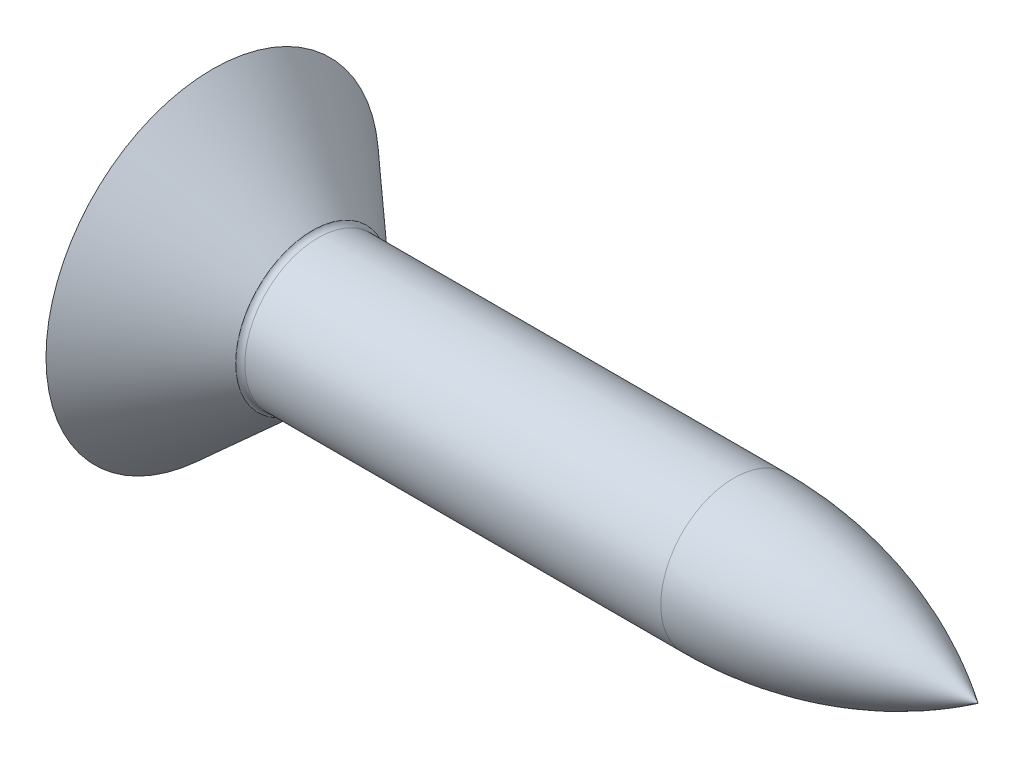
ISO-10303-21;
HEADER;
FILE_DESCRIPTION(('STEP AP214'),'2;1');
FILE_NAME('part.step','',(''),(''),'','','');
FILE_SCHEMA(('AUTOMOTIVE_DESIGN { 1 0 10303 214 1 1 1 1 }'));
ENDSEC;
DATA;
#1=APPLICATION_CONTEXT('core data for automotive mechanical design processes');
#2=APPLICATION_PROTOCOL_DEFINITION('international standard','automotive_design',2000,#1);
#3=PRODUCT_CONTEXT('',#1,'mechanical');
#4=PRODUCT('Part','Part','',(#3));
#5=PRODUCT_RELATED_PRODUCT_CATEGORY('part','',(#4));
#6=PRODUCT_DEFINITION_FORMATION('','',#4);
#7=PRODUCT_DEFINITION_CONTEXT('part definition',#1,'design');
#8=PRODUCT_DEFINITION('design','',#6,#7);
#9=PRODUCT_DEFINITION_SHAPE('','',#8);
#10=(LENGTH_UNIT() NAMED_UNIT(*) SI_UNIT(.MILLI.,.METRE.));
#11=(NAMED_UNIT(*) PLANE_ANGLE_UNIT() SI_UNIT($,.RADIAN.));
#12=(NAMED_UNIT(*) SI_UNIT($,.STERADIAN.) SOLID_ANGLE_UNIT());
#13=UNCERTAINTY_MEASURE_WITH_UNIT(LENGTH_MEASURE(1.E-05),#10,'distance_accuracy_value','');
#14=(GEOMETRIC_REPRESENTATION_CONTEXT(3) GLOBAL_UNCERTAINTY_ASSIGNED_CONTEXT((#13)) GLOBAL_UNIT_ASSIGNED_CONTEXT((#10,
#11,#12)) REPRESENTATION_CONTEXT('',''));
#15=CARTESIAN_POINT('',(0.,0.,0.));
#16=DIRECTION('',(0.,0.,1.));
#17=DIRECTION('',(1.,0.,0.));
#18=AXIS2_PLACEMENT_3D('',#15,#16,#17);
#19=CARTESIAN_POINT('',(0.,0.,0.));
#20=DIRECTION('',(-1.,0.,0.));
#21=DIRECTION('',(0.,0.,1.));
#22=AXIS2_PLACEMENT_3D('',#19,#20,#21);
#23=PLANE('',#22);
#24=CARTESIAN_POINT('',(0.,0.,0.));
#25=DIRECTION('',(-1.,0.,0.));
#26=DIRECTION('',(0.,0.,1.));
#27=AXIS2_PLACEMENT_3D('',#24,#25,#26);
#28=CIRCLE('',#27,2.5);
#29=CARTESIAN_POINT('',(0.,0.,2.5));
#30=VERTEX_POINT('',#29);
#31=EDGE_CURVE('E214',#30,#30,#28,.T.);
#32=ORIENTED_EDGE('',*,*,#31,.T.);
#33=EDGE_LOOP('',(#32));
#34=FACE_BOUND('',#33,.T.);
#35=DIRECTION('',(0.,0.,-1.));
#36=VECTOR('',#35,1.);
#37=CARTESIAN_POINT('',(0.,-0.370000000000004,1.3));
#38=LINE('',#37,#36);
#39=CARTESIAN_POINT('',(0.,-0.370000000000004,1.3));
#40=VERTEX_POINT('',#39);
#41=CARTESIAN_POINT('',(0.,-0.370000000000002,0.547609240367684));
#42=VERTEX_POINT('',#41);
#43=EDGE_CURVE('E468',#40,#42,#38,.T.);
#44=ORIENTED_EDGE('',*,*,#43,.T.);
#45=CARTESIAN_POINT('',(0.,0.,0.));
#46=DIRECTION('',(-1.,0.,0.));
#47=DIRECTION('',(0.,0.,1.));
#48=AXIS2_PLACEMENT_3D('',#45,#46,#47);
#49=CIRCLE('',#48,0.660890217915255);
#50=CARTESIAN_POINT('',(0.,-0.547609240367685,0.369999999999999));
#51=VERTEX_POINT('',#50);
#52=EDGE_CURVE('E343',#51,#42,#49,.T.);
#53=ORIENTED_EDGE('',*,*,#52,.F.);
#54=DIRECTION('',(0.,-1.,0.));
#55=VECTOR('',#54,1.);
#56=CARTESIAN_POINT('',(0.,1.3,0.37));
#57=LINE('',#56,#55);
#58=CARTESIAN_POINT('',(0.,-1.3,0.369999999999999));
#59=VERTEX_POINT('',#58);
#60=EDGE_CURVE('E416',#51,#59,#57,.T.);
#61=ORIENTED_EDGE('',*,*,#60,.T.);
#62=DIRECTION('',(0.,0.,1.));
#63=VECTOR('',#62,1.);
#64=CARTESIAN_POINT('',(0.,-1.3,-0.37));
#65=LINE('',#64,#63);
#66=CARTESIAN_POINT('',(0.,-1.3,-0.37));
#67=VERTEX_POINT('',#66);
#68=EDGE_CURVE('E219',#67,#59,#65,.T.);
#69=ORIENTED_EDGE('',*,*,#68,.F.);
#70=DIRECTION('',(0.,1.,0.));
#71=VECTOR('',#70,1.);
#72=CARTESIAN_POINT('',(0.,-1.3,-0.37));
#73=LINE('',#72,#71);
#74=CARTESIAN_POINT('',(0.,-0.547609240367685,-0.37));
#75=VERTEX_POINT('',#74);
#76=EDGE_CURVE('E49',#67,#75,#73,.T.);
#77=ORIENTED_EDGE('',*,*,#76,.T.);
#78=CARTESIAN_POINT('',(0.,-0.369999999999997,-0.547609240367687));
#79=VERTEX_POINT('',#78);
#80=EDGE_CURVE('E346',#79,#75,#49,.T.);
#81=ORIENTED_EDGE('',*,*,#80,.F.);
#82=CARTESIAN_POINT('',(0.,-0.369999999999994,-1.3));
#83=VERTEX_POINT('',#82);
#84=EDGE_CURVE('E467',#79,#83,#38,.T.);
#85=ORIENTED_EDGE('',*,*,#84,.T.);
#86=DIRECTION('',(0.,-1.,0.));
#87=VECTOR('',#86,1.);
#88=CARTESIAN_POINT('',(0.,0.370000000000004,-1.3));
#89=LINE('',#88,#87);
#90=CARTESIAN_POINT('',(0.,0.370000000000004,-1.3));
#91=VERTEX_POINT('',#90);
#92=EDGE_CURVE('E427',#91,#83,#89,.T.);
#93=ORIENTED_EDGE('',*,*,#92,.F.);
#94=DIRECTION('',(0.,0.,1.));
#95=VECTOR('',#94,1.);
#96=CARTESIAN_POINT('',(0.,0.370000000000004,-1.3));
#97=LINE('',#96,#95);
#98=CARTESIAN_POINT('',(0.,0.370000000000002,-0.547609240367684));
#99=VERTEX_POINT('',#98);
#100=EDGE_CURVE('E461',#91,#99,#97,.T.);
#101=ORIENTED_EDGE('',*,*,#100,.T.);
#102=CARTESIAN_POINT('',(0.,0.547609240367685,-0.37));
#103=VERTEX_POINT('',#102);
#104=EDGE_CURVE('E342',#103,#99,#49,.T.);
#105=ORIENTED_EDGE('',*,*,#104,.F.);
#106=CARTESIAN_POINT('',(0.,1.3,-0.37));
#107=VERTEX_POINT('',#106);
#108=EDGE_CURVE('E410',#103,#107,#73,.T.);
#109=ORIENTED_EDGE('',*,*,#108,.T.);
#110=DIRECTION('',(0.,0.,-1.));
#111=VECTOR('',#110,1.);
#112=CARTESIAN_POINT('',(0.,1.3,0.37));
#113=LINE('',#112,#111);
#114=CARTESIAN_POINT('',(0.,1.3,0.37));
#115=VERTEX_POINT('',#114);
#116=EDGE_CURVE('E417',#115,#107,#113,.T.);
#117=ORIENTED_EDGE('',*,*,#116,.F.);
#118=CARTESIAN_POINT('',(0.,0.547609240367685,0.37));
#119=VERTEX_POINT('',#118);
#120=EDGE_CURVE('E414',#115,#119,#57,.T.);
#121=ORIENTED_EDGE('',*,*,#120,.T.);
#122=CARTESIAN_POINT('',(0.,0.369999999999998,0.547609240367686));
#123=VERTEX_POINT('',#122);
#124=EDGE_CURVE('E338',#123,#119,#49,.T.);
#125=ORIENTED_EDGE('',*,*,#124,.F.);
#126=CARTESIAN_POINT('',(0.,0.369999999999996,1.3));
#127=VERTEX_POINT('',#126);
#128=EDGE_CURVE('E464',#123,#127,#97,.T.);
#129=ORIENTED_EDGE('',*,*,#128,.T.);
#130=DIRECTION('',(0.,1.,0.));
#131=VECTOR('',#130,1.);
#132=CARTESIAN_POINT('',(0.,-0.370000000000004,1.3));
#133=LINE('',#132,#131);
#134=EDGE_CURVE('E463',#40,#127,#133,.T.);
#135=ORIENTED_EDGE('',*,*,#134,.F.);
#136=EDGE_LOOP('',(#44,#53,#61,#69,#77,#81,#85,#93,#101,#105,#109,#117,#121,#125,#129,#135));
#137=FACE_BOUND('',#136,.T.);
#138=ADVANCED_FACE('F26',(#34,#137),#23,.T.);
#139=CARTESIAN_POINT('',(1.5,0.552127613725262,-0.37));
#140=DIRECTION('',(0.,0.,1.));
#141=DIRECTION('',(0.,-1.,0.));
#142=AXIS2_PLACEMENT_3D('',#139,#140,#141);
#143=PLANE('',#142);
#144=ORIENTED_EDGE('',*,*,#108,.F.);
#145=CARTESIAN_POINT('',(-1.01786528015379,0.631681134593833,-0.37));
#146=CARTESIAN_POINT('',(-0.81671122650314,0.615372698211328,-0.37));
#147=CARTESIAN_POINT('',(-0.615568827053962,0.598917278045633,-0.37));
#148=CARTESIAN_POINT('',(-0.213313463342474,0.565594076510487,-0.37));
#149=CARTESIAN_POINT('',(-0.0122004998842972,0.548726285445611,-0.37));
#150=CARTESIAN_POINT('',(0.38998037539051,0.514460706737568,-0.37));
#151=CARTESIAN_POINT('',(0.591048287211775,0.497062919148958,-0.37));
#152=CARTESIAN_POINT('',(0.993117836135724,0.461546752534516,-0.37));
#153=CARTESIAN_POINT('',(1.19411947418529,0.443428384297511,-0.37));
#154=CARTESIAN_POINT('',(1.51280354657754,0.413874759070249,-0.37));
#155=CARTESIAN_POINT('',(1.63051742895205,0.402779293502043,-0.37));
#156=CARTESIAN_POINT('',(1.86590055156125,0.380130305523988,-0.37));
#157=CARTESIAN_POINT('',(1.98356979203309,0.368576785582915,-0.37));
#158=CARTESIAN_POINT('',(2.21885433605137,0.344876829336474,-0.37));
#159=CARTESIAN_POINT('',(2.33646963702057,0.332730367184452,-0.37));
#160=CARTESIAN_POINT('',(2.57161134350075,0.30758754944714,-0.37));
#161=CARTESIAN_POINT('',(2.68913774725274,0.294591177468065,-0.37));
#162=CARTESIAN_POINT('',(2.80660252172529,0.281041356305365,-0.37));
#163=B_SPLINE_CURVE_WITH_KNOTS('',3,(#145,#146,#147,#148,#149,#150,#151,#152,#153,#154,#155,
#156,#157,#158,#159,#160,#161,#162),.UNSPECIFIED.,.F.,.F.,(4,2,2,2,2,2,2,2,4),(0.,
0.605442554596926,1.21089935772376,1.81635609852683,2.42180377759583,2.77650999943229,
3.13121430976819,3.48593409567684,3.84066072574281),.UNSPECIFIED.);
#164=CARTESIAN_POINT('',(1.5,0.415013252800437,-0.370000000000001));
#165=VERTEX_POINT('',#164);
#166=EDGE_CURVE('E251',#103,#165,#163,.T.);
#167=ORIENTED_EDGE('',*,*,#166,.T.);
#168=DIRECTION('',(0.,1.,0.));
#169=VECTOR('',#168,1.);
#170=CARTESIAN_POINT('',(1.5,-0.552127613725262,-0.37));
#171=LINE('',#170,#169);
#172=CARTESIAN_POINT('',(1.5,0.552127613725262,-0.37));
#173=VERTEX_POINT('',#172);
#174=EDGE_CURVE('E400',#165,#173,#171,.T.);
#175=ORIENTED_EDGE('',*,*,#174,.T.);
#176=DIRECTION('',(0.89493436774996,-0.446197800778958,0.));
#177=VECTOR('',#176,1.);
#178=CARTESIAN_POINT('',(0.,1.3,-0.37));
#179=LINE('',#178,#177);
#180=EDGE_CURVE('E408',#107,#173,#179,.T.);
#181=ORIENTED_EDGE('',*,*,#180,.F.);
#182=EDGE_LOOP('',(#144,#167,#175,#181));
#183=FACE_BOUND('',#182,.T.);
#184=ADVANCED_FACE('F183',(#183),#143,.T.);
#185=CARTESIAN_POINT('',(1.5,-0.552127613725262,-0.37));
#186=VERTEX_POINT('',#185);
#187=CARTESIAN_POINT('',(1.5,-0.415013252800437,-0.370000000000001));
#188=VERTEX_POINT('',#187);
#189=EDGE_CURVE('E395',#186,#188,#171,.T.);
#190=ORIENTED_EDGE('',*,*,#189,.T.);
#191=CARTESIAN_POINT('',(-1.01786528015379,-0.631681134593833,-0.37));
#192=CARTESIAN_POINT('',(-0.81671122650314,-0.615372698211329,-0.37));
#193=CARTESIAN_POINT('',(-0.615568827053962,-0.598917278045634,-0.37));
#194=CARTESIAN_POINT('',(-0.213313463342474,-0.565594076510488,-0.37));
#195=CARTESIAN_POINT('',(-0.012200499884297,-0.548726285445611,-0.37));
#196=CARTESIAN_POINT('',(0.38998037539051,-0.514460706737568,-0.37));
#197=CARTESIAN_POINT('',(0.591048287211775,-0.497062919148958,-0.37));
#198=CARTESIAN_POINT('',(0.993117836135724,-0.461546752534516,-0.37));
#199=CARTESIAN_POINT('',(1.19411947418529,-0.443428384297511,-0.37));
#200=CARTESIAN_POINT('',(1.51280354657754,-0.413874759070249,-0.37));
#201=CARTESIAN_POINT('',(1.63051742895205,-0.402779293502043,-0.37));
#202=CARTESIAN_POINT('',(1.86590055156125,-0.380130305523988,-0.37));
#203=CARTESIAN_POINT('',(1.9835697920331,-0.368576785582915,-0.37));
#204=CARTESIAN_POINT('',(2.21885433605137,-0.344876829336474,-0.37));
#205=CARTESIAN_POINT('',(2.33646963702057,-0.332730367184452,-0.37));
#206=CARTESIAN_POINT('',(2.57161134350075,-0.30758754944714,-0.37));
#207=CARTESIAN_POINT('',(2.68913774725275,-0.294591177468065,-0.37));
#208=CARTESIAN_POINT('',(2.80660252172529,-0.281041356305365,-0.37));
#209=B_SPLINE_CURVE_WITH_KNOTS('',3,(#191,#192,#193,#194,#195,#196,#197,#198,#199,#200,#201,
#202,#203,#204,#205,#206,#207,#208),.UNSPECIFIED.,.F.,.F.,(4,2,2,2,2,2,2,2,4),(0.,
0.605442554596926,1.21089935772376,1.81635609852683,2.42180377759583,2.77650999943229,
3.13121430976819,3.48593409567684,3.84066072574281),.UNSPECIFIED.);
#210=EDGE_CURVE('E245',#188,#75,#209,.F.);
#211=ORIENTED_EDGE('',*,*,#210,.T.);
#212=ORIENTED_EDGE('',*,*,#76,.F.);
#213=DIRECTION('',(0.89493436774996,0.446197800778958,0.));
#214=VECTOR('',#213,1.);
#215=CARTESIAN_POINT('',(0.,-1.3,-0.37));
#216=LINE('',#215,#214);
#217=EDGE_CURVE('E404',#67,#186,#216,.T.);
#218=ORIENTED_EDGE('',*,*,#217,.T.);
#219=EDGE_LOOP('',(#190,#211,#212,#218));
#220=FACE_BOUND('',#219,.T.);
#221=ADVANCED_FACE('F190',(#220),#143,.T.);
#222=CARTESIAN_POINT('',(1.5,-0.552127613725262,0.369999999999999));
#223=DIRECTION('',(0.,0.,-1.));
#224=DIRECTION('',(0.,1.,0.));
#225=AXIS2_PLACEMENT_3D('',#222,#223,#224);
#226=PLANE('',#225);
#227=DIRECTION('',(0.,-1.,0.));
#228=VECTOR('',#227,1.);
#229=CARTESIAN_POINT('',(1.5,0.552127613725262,0.37));
#230=LINE('',#229,#228);
#231=CARTESIAN_POINT('',(1.5,0.552127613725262,0.37));
#232=VERTEX_POINT('',#231);
#233=CARTESIAN_POINT('',(1.5,0.415013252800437,0.370000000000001));
#234=VERTEX_POINT('',#233);
#235=EDGE_CURVE('E390',#232,#234,#230,.T.);
#236=ORIENTED_EDGE('',*,*,#235,.T.);
#237=CARTESIAN_POINT('',(-1.01786528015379,0.631681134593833,0.37));
#238=CARTESIAN_POINT('',(-0.81671122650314,0.615372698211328,0.37));
#239=CARTESIAN_POINT('',(-0.615568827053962,0.598917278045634,0.37));
#240=CARTESIAN_POINT('',(-0.213313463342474,0.565594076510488,0.37));
#241=CARTESIAN_POINT('',(-0.0122004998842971,0.548726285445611,0.37));
#242=CARTESIAN_POINT('',(0.38998037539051,0.514460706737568,0.37));
#243=CARTESIAN_POINT('',(0.591048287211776,0.497062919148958,0.37));
#244=CARTESIAN_POINT('',(0.993117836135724,0.461546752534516,0.37));
#245=CARTESIAN_POINT('',(1.19411947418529,0.443428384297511,0.37));
#246=CARTESIAN_POINT('',(1.51280354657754,0.413874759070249,0.37));
#247=CARTESIAN_POINT('',(1.63051742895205,0.402779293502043,0.37));
#248=CARTESIAN_POINT('',(1.86590055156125,0.380130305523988,0.37));
#249=CARTESIAN_POINT('',(1.9835697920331,0.368576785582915,0.37));
#250=CARTESIAN_POINT('',(2.21885433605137,0.344876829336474,0.37));
#251=CARTESIAN_POINT('',(2.33646963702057,0.332730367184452,0.37));
#252=CARTESIAN_POINT('',(2.57161134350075,0.307587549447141,0.37));
#253=CARTESIAN_POINT('',(2.68913774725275,0.294591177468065,0.37));
#254=CARTESIAN_POINT('',(2.80660252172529,0.281041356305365,0.37));
#255=B_SPLINE_CURVE_WITH_KNOTS('',3,(#237,#238,#239,#240,#241,#242,#243,#244,#245,#246,#247,
#248,#249,#250,#251,#252,#253,#254),.UNSPECIFIED.,.F.,.F.,(4,2,2,2,2,2,2,2,4),(0.,
0.605442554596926,1.21089935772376,1.81635609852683,2.42180377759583,2.77650999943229,
3.13121430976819,3.48593409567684,3.84066072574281),.UNSPECIFIED.);
#256=EDGE_CURVE('E300',#234,#119,#255,.F.);
#257=ORIENTED_EDGE('',*,*,#256,.T.);
#258=ORIENTED_EDGE('',*,*,#120,.F.);
#259=DIRECTION('',(0.89493436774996,-0.446197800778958,0.));
#260=VECTOR('',#259,1.);
#261=CARTESIAN_POINT('',(0.,1.3,0.37));
#262=LINE('',#261,#260);
#263=EDGE_CURVE('E407',#115,#232,#262,.T.);
#264=ORIENTED_EDGE('',*,*,#263,.T.);
#265=EDGE_LOOP('',(#236,#257,#258,#264));
#266=FACE_BOUND('',#265,.T.);
#267=ADVANCED_FACE('F240',(#266),#226,.T.);
#268=ORIENTED_EDGE('',*,*,#60,.F.);
#269=CARTESIAN_POINT('',(-1.01786528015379,-0.631681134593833,0.369999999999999));
#270=CARTESIAN_POINT('',(-0.81671122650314,-0.615372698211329,0.369999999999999));
#271=CARTESIAN_POINT('',(-0.615568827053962,-0.598917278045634,0.369999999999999));
#272=CARTESIAN_POINT('',(-0.213313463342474,-0.565594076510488,0.369999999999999));
#273=CARTESIAN_POINT('',(-0.0122004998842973,-0.548726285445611,0.369999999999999));
#274=CARTESIAN_POINT('',(0.38998037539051,-0.514460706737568,0.369999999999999));
#275=CARTESIAN_POINT('',(0.591048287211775,-0.497062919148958,0.369999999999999));
#276=CARTESIAN_POINT('',(0.993117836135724,-0.461546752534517,0.369999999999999));
#277=CARTESIAN_POINT('',(1.19411947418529,-0.443428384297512,0.369999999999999));
#278=CARTESIAN_POINT('',(1.51280354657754,-0.41387475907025,0.369999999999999));
#279=CARTESIAN_POINT('',(1.63051742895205,-0.402779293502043,0.37));
#280=CARTESIAN_POINT('',(1.86590055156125,-0.380130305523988,0.37));
#281=CARTESIAN_POINT('',(1.98356979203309,-0.368576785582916,0.37));
#282=CARTESIAN_POINT('',(2.21885433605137,-0.344876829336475,0.37));
#283=CARTESIAN_POINT('',(2.33646963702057,-0.332730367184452,0.37));
#284=CARTESIAN_POINT('',(2.57161134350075,-0.307587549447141,0.37));
#285=CARTESIAN_POINT('',(2.68913774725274,-0.294591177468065,0.37));
#286=CARTESIAN_POINT('',(2.80660252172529,-0.281041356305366,0.37));
#287=B_SPLINE_CURVE_WITH_KNOTS('',3,(#269,#270,#271,#272,#273,#274,#275,#276,#277,#278,#279,
#280,#281,#282,#283,#284,#285,#286),.UNSPECIFIED.,.F.,.F.,(4,2,2,2,2,2,2,2,4),(0.,
0.605442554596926,1.21089935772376,1.81635609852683,2.42180377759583,2.77650999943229,
3.13121430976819,3.48593409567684,3.84066072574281),.UNSPECIFIED.);
#288=CARTESIAN_POINT('',(1.5,-0.415013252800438,0.37));
#289=VERTEX_POINT('',#288);
#290=EDGE_CURVE('E295',#51,#289,#287,.T.);
#291=ORIENTED_EDGE('',*,*,#290,.T.);
#292=CARTESIAN_POINT('',(1.5,-0.552127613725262,0.369999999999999));
#293=VERTEX_POINT('',#292);
#294=EDGE_CURVE('E392',#289,#293,#230,.T.);
#295=ORIENTED_EDGE('',*,*,#294,.T.);
#296=DIRECTION('',(0.89493436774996,0.446197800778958,0.));
#297=VECTOR('',#296,1.);
#298=CARTESIAN_POINT('',(0.,-1.3,0.369999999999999));
#299=LINE('',#298,#297);
#300=EDGE_CURVE('E401',#59,#293,#299,.T.);
#301=ORIENTED_EDGE('',*,*,#300,.F.);
#302=EDGE_LOOP('',(#268,#291,#295,#301));
#303=FACE_BOUND('',#302,.T.);
#304=ADVANCED_FACE('F442',(#303),#226,.T.);
#305=CARTESIAN_POINT('',(1.5,0.552127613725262,-0.37));
#306=DIRECTION('',(-1.,0.,0.));
#307=DIRECTION('',(0.,0.,1.));
#308=AXIS2_PLACEMENT_3D('',#305,#306,#307);
#309=PLANE('',#308);
#310=DIRECTION('',(0.,1.,0.));
#311=VECTOR('',#310,1.);
#312=CARTESIAN_POINT('',(1.5,-0.370000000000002,0.55212761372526));
#313=LINE('',#312,#311);
#314=CARTESIAN_POINT('',(1.5,-0.370000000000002,0.55212761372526));
#315=VERTEX_POINT('',#314);
#316=CARTESIAN_POINT('',(1.5,-0.0655064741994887,0.552127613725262));
#317=VERTEX_POINT('',#316);
#318=EDGE_CURVE('E487',#315,#317,#313,.T.);
#319=ORIENTED_EDGE('',*,*,#318,.T.);
#320=CARTESIAN_POINT('',(1.5,0.,0.));
#321=DIRECTION('',(-1.,0.,0.));
#322=DIRECTION('',(0.,0.,1.));
#323=AXIS2_PLACEMENT_3D('',#320,#321,#322);
#324=CIRCLE('',#323,0.556);
#325=CARTESIAN_POINT('',(1.5,-0.370000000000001,0.415013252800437));
#326=VERTEX_POINT('',#325);
#327=EDGE_CURVE('E355',#326,#317,#324,.T.);
#328=ORIENTED_EDGE('',*,*,#327,.F.);
#329=DIRECTION('',(0.,0.,-1.));
#330=VECTOR('',#329,1.);
#331=CARTESIAN_POINT('',(1.5,-0.370000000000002,0.55212761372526));
#332=LINE('',#331,#330);
#333=EDGE_CURVE('E490',#315,#326,#332,.T.);
#334=ORIENTED_EDGE('',*,*,#333,.F.);
#335=EDGE_LOOP('',(#319,#328,#334));
#336=FACE_BOUND('',#335,.T.);
#337=ADVANCED_FACE('F438',(#336),#309,.T.);
#338=ORIENTED_EDGE('',*,*,#294,.F.);
#339=CARTESIAN_POINT('',(1.5,-0.552127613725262,0.0655064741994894));
#340=VERTEX_POINT('',#339);
#341=EDGE_CURVE('E360',#340,#289,#324,.T.);
#342=ORIENTED_EDGE('',*,*,#341,.F.);
#343=DIRECTION('',(0.,0.,1.));
#344=VECTOR('',#343,1.);
#345=CARTESIAN_POINT('',(1.5,-0.552127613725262,-0.37));
#346=LINE('',#345,#344);
#347=EDGE_CURVE('E456',#340,#293,#346,.T.);
#348=ORIENTED_EDGE('',*,*,#347,.T.);
#349=EDGE_LOOP('',(#338,#342,#348));
#350=FACE_BOUND('',#349,.T.);
#351=ADVANCED_FACE('F441',(#350),#309,.T.);
#352=CARTESIAN_POINT('',(1.5,-0.552127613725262,-0.0655064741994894));
#353=VERTEX_POINT('',#352);
#354=EDGE_CURVE('E405',#186,#353,#346,.T.);
#355=ORIENTED_EDGE('',*,*,#354,.T.);
#356=EDGE_CURVE('E364',#188,#353,#324,.T.);
#357=ORIENTED_EDGE('',*,*,#356,.F.);
#358=ORIENTED_EDGE('',*,*,#189,.F.);
#359=EDGE_LOOP('',(#355,#357,#358));
#360=FACE_BOUND('',#359,.T.);
#361=ADVANCED_FACE('F459',(#360),#309,.T.);
#362=CARTESIAN_POINT('',(1.5,-0.369999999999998,-0.415013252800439));
#363=VERTEX_POINT('',#362);
#364=CARTESIAN_POINT('',(1.5,-0.369999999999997,-0.552127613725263));
#365=VERTEX_POINT('',#364);
#366=EDGE_CURVE('E489',#363,#365,#332,.T.);
#367=ORIENTED_EDGE('',*,*,#366,.F.);
#368=CARTESIAN_POINT('',(1.5,-0.0655064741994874,-0.552127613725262));
#369=VERTEX_POINT('',#368);
#370=EDGE_CURVE('E369',#369,#363,#324,.T.);
#371=ORIENTED_EDGE('',*,*,#370,.F.);
#372=DIRECTION('',(0.,-1.,0.));
#373=VECTOR('',#372,1.);
#374=CARTESIAN_POINT('',(1.5,0.370000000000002,-0.55212761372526));
#375=LINE('',#374,#373);
#376=EDGE_CURVE('E491',#369,#365,#375,.T.);
#377=ORIENTED_EDGE('',*,*,#376,.T.);
#378=EDGE_LOOP('',(#367,#371,#377));
#379=FACE_BOUND('',#378,.T.);
#380=ADVANCED_FACE('F436',(#379),#309,.T.);
#381=CARTESIAN_POINT('',(1.5,0.370000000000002,-0.55212761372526));
#382=VERTEX_POINT('',#381);
#383=CARTESIAN_POINT('',(1.5,0.0655064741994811,-0.552127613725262));
#384=VERTEX_POINT('',#383);
#385=EDGE_CURVE('E258',#382,#384,#375,.T.);
#386=ORIENTED_EDGE('',*,*,#385,.T.);
#387=CARTESIAN_POINT('',(1.5,0.370000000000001,-0.415013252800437));
#388=VERTEX_POINT('',#387);
#389=EDGE_CURVE('E41',#388,#384,#324,.T.);
#390=ORIENTED_EDGE('',*,*,#389,.F.);
#391=DIRECTION('',(0.,0.,1.));
#392=VECTOR('',#391,1.);
#393=CARTESIAN_POINT('',(1.5,0.370000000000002,-0.55212761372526));
#394=LINE('',#393,#392);
#395=EDGE_CURVE('E484',#382,#388,#394,.T.);
#396=ORIENTED_EDGE('',*,*,#395,.F.);
#397=EDGE_LOOP('',(#386,#390,#396));
#398=FACE_BOUND('',#397,.T.);
#399=ADVANCED_FACE('F430',(#398),#309,.T.);
#400=ORIENTED_EDGE('',*,*,#174,.F.);
#401=CARTESIAN_POINT('',(1.5,0.552127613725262,-0.0655064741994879));
#402=VERTEX_POINT('',#401);
#403=EDGE_CURVE('E374',#402,#165,#324,.T.);
#404=ORIENTED_EDGE('',*,*,#403,.F.);
#405=DIRECTION('',(0.,0.,-1.));
#406=VECTOR('',#405,1.);
#407=CARTESIAN_POINT('',(1.5,0.552127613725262,0.37));
#408=LINE('',#407,#406);
#409=EDGE_CURVE('E388',#402,#173,#408,.T.);
#410=ORIENTED_EDGE('',*,*,#409,.T.);
#411=EDGE_LOOP('',(#400,#404,#410));
#412=FACE_BOUND('',#411,.T.);
#413=ADVANCED_FACE('F428',(#412),#309,.T.);
#414=CARTESIAN_POINT('',(1.5,0.552127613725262,0.0655064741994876));
#415=VERTEX_POINT('',#414);
#416=EDGE_CURVE('E385',#232,#415,#408,.T.);
#417=ORIENTED_EDGE('',*,*,#416,.T.);
#418=EDGE_CURVE('E354',#234,#415,#324,.T.);
#419=ORIENTED_EDGE('',*,*,#418,.F.);
#420=ORIENTED_EDGE('',*,*,#235,.F.);
#421=EDGE_LOOP('',(#417,#419,#420));
#422=FACE_BOUND('',#421,.T.);
#423=ADVANCED_FACE('F389',(#422),#309,.T.);
#424=CARTESIAN_POINT('',(1.5,0.369999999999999,0.415013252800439));
#425=VERTEX_POINT('',#424);
#426=CARTESIAN_POINT('',(1.5,0.369999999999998,0.552127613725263));
#427=VERTEX_POINT('',#426);
#428=EDGE_CURVE('E257',#425,#427,#394,.T.);
#429=ORIENTED_EDGE('',*,*,#428,.F.);
#430=CARTESIAN_POINT('',(1.5,0.0655064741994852,0.552127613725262));
#431=VERTEX_POINT('',#430);
#432=EDGE_CURVE('E348',#431,#425,#324,.T.);
#433=ORIENTED_EDGE('',*,*,#432,.F.);
#434=EDGE_CURVE('E486',#431,#427,#313,.T.);
#435=ORIENTED_EDGE('',*,*,#434,.T.);
#436=EDGE_LOOP('',(#429,#433,#435));
#437=FACE_BOUND('',#436,.T.);
#438=ADVANCED_FACE('F236',(#437),#309,.T.);
#439=CARTESIAN_POINT('',(1.5,0.552127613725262,0.37));
#440=DIRECTION('',(0.446197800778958,0.89493436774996,0.));
#441=DIRECTION('',(-0.89493436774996,0.446197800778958,0.));
#442=AXIS2_PLACEMENT_3D('',#439,#440,#441);
#443=PLANE('',#442);
#444=CARTESIAN_POINT('',(2.47007520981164,0.0684659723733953,0.));
#445=DIRECTION('',(0.446197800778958,0.89493436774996,0.));
#446=DIRECTION('',(-0.89493436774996,0.446197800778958,0.));
#447=AXIS2_PLACEMENT_3D('',#444,#445,#446);
#448=ELLIPSE('',#447,1.09405678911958,0.483340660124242);
#449=EDGE_CURVE('E309',#415,#402,#448,.F.);
#450=ORIENTED_EDGE('',*,*,#449,.F.);
#451=ORIENTED_EDGE('',*,*,#416,.F.);
#452=ORIENTED_EDGE('',*,*,#263,.F.);
#453=ORIENTED_EDGE('',*,*,#116,.T.);
#454=ORIENTED_EDGE('',*,*,#180,.T.);
#455=ORIENTED_EDGE('',*,*,#409,.F.);
#456=EDGE_LOOP('',(#450,#451,#452,#453,#454,#455));
#457=FACE_BOUND('',#456,.T.);
#458=ADVANCED_FACE('F233',(#457),#443,.F.);
#459=CARTESIAN_POINT('',(0.,-1.3,-0.37));
#460=DIRECTION('',(0.446197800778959,-0.89493436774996,0.));
#461=DIRECTION('',(0.89493436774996,0.446197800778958,0.));
#462=AXIS2_PLACEMENT_3D('',#459,#460,#461);
#463=PLANE('',#462);
#464=CARTESIAN_POINT('',(2.47007520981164,-0.0684659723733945,0.));
#465=DIRECTION('',(0.446197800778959,-0.89493436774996,0.));
#466=DIRECTION('',(-0.89493436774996,-0.446197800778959,0.));
#467=AXIS2_PLACEMENT_3D('',#464,#465,#466);
#468=ELLIPSE('',#467,1.09405678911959,0.483340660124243);
#469=EDGE_CURVE('E313',#353,#340,#468,.F.);
#470=ORIENTED_EDGE('',*,*,#469,.F.);
#471=ORIENTED_EDGE('',*,*,#354,.F.);
#472=ORIENTED_EDGE('',*,*,#217,.F.);
#473=ORIENTED_EDGE('',*,*,#68,.T.);
#474=ORIENTED_EDGE('',*,*,#300,.T.);
#475=ORIENTED_EDGE('',*,*,#347,.F.);
#476=EDGE_LOOP('',(#470,#471,#472,#473,#474,#475));
#477=FACE_BOUND('',#476,.T.);
#478=ADVANCED_FACE('F235',(#477),#463,.F.);
#479=CARTESIAN_POINT('',(1.5,0.369999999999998,0.552127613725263));
#480=DIRECTION('',(0.,-1.,0.));
#481=DIRECTION('',(0.,0.,-1.));
#482=AXIS2_PLACEMENT_3D('',#479,#480,#481);
#483=PLANE('',#482);
#484=ORIENTED_EDGE('',*,*,#128,.F.);
#485=CARTESIAN_POINT('',(-1.01786528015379,0.369999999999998,0.631681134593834));
#486=CARTESIAN_POINT('',(-0.81671122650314,0.369999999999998,0.61537269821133));
#487=CARTESIAN_POINT('',(-0.615568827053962,0.369999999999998,0.598917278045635));
#488=CARTESIAN_POINT('',(-0.213313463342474,0.369999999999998,0.565594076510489));
#489=CARTESIAN_POINT('',(-0.0122004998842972,0.369999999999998,0.548726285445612));
#490=CARTESIAN_POINT('',(0.38998037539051,0.369999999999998,0.514460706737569));
#491=CARTESIAN_POINT('',(0.591048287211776,0.369999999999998,0.497062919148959));
#492=CARTESIAN_POINT('',(0.993117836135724,0.369999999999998,0.461546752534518));
#493=CARTESIAN_POINT('',(1.19411947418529,0.369999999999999,0.443428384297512));
#494=CARTESIAN_POINT('',(1.51280354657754,0.369999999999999,0.41387475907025));
#495=CARTESIAN_POINT('',(1.63051742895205,0.369999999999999,0.402779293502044));
#496=CARTESIAN_POINT('',(1.86590055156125,0.369999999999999,0.380130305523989));
#497=CARTESIAN_POINT('',(1.9835697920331,0.369999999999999,0.368576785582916));
#498=CARTESIAN_POINT('',(2.21885433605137,0.369999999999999,0.344876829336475));
#499=CARTESIAN_POINT('',(2.33646963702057,0.369999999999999,0.332730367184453));
#500=CARTESIAN_POINT('',(2.57161134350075,0.369999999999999,0.307587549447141));
#501=CARTESIAN_POINT('',(2.68913774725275,0.369999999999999,0.294591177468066));
#502=CARTESIAN_POINT('',(2.80660252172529,0.369999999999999,0.281041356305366));
#503=B_SPLINE_CURVE_WITH_KNOTS('',3,(#485,#486,#487,#488,#489,#490,#491,#492,#493,#494,#495,
#496,#497,#498,#499,#500,#501,#502),.UNSPECIFIED.,.F.,.F.,(4,2,2,2,2,2,2,2,4),(0.,
0.605442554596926,1.21089935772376,1.81635609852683,2.42180377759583,2.77650999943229,
3.13121430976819,3.48593409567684,3.84066072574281),.UNSPECIFIED.);
#504=EDGE_CURVE('E288',#123,#425,#503,.T.);
#505=ORIENTED_EDGE('',*,*,#504,.T.);
#506=ORIENTED_EDGE('',*,*,#428,.T.);
#507=DIRECTION('',(0.89493436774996,0.,-0.446197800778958));
#508=VECTOR('',#507,1.);
#509=CARTESIAN_POINT('',(0.,0.369999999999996,1.3));
#510=LINE('',#509,#508);
#511=EDGE_CURVE('E475',#127,#427,#510,.T.);
#512=ORIENTED_EDGE('',*,*,#511,.F.);
#513=EDGE_LOOP('',(#484,#505,#506,#512));
#514=FACE_BOUND('',#513,.T.);
#515=ADVANCED_FACE('F446',(#514),#483,.T.);
#516=CARTESIAN_POINT('',(1.5,-0.369999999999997,-0.552127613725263));
#517=DIRECTION('',(0.,1.,0.));
#518=DIRECTION('',(0.,0.,1.));
#519=AXIS2_PLACEMENT_3D('',#516,#517,#518);
#520=PLANE('',#519);
#521=ORIENTED_EDGE('',*,*,#333,.T.);
#522=CARTESIAN_POINT('',(-1.01786528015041,-0.370000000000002,0.631681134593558));
#523=CARTESIAN_POINT('',(-0.816711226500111,-0.370000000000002,0.61537269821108));
#524=CARTESIAN_POINT('',(-0.615568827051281,-0.370000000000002,0.598917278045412));
#525=CARTESIAN_POINT('',(-0.213313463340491,-0.370000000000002,0.56559407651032));
#526=CARTESIAN_POINT('',(-0.012200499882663,-0.370000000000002,0.548726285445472));
#527=CARTESIAN_POINT('',(0.389980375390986,-0.370000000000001,0.514460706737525));
#528=CARTESIAN_POINT('',(0.591048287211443,-0.370000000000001,0.497062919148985));
#529=CARTESIAN_POINT('',(0.993117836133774,-0.370000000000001,0.461546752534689));
#530=CARTESIAN_POINT('',(1.19411947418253,-0.370000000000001,0.44342838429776));
#531=CARTESIAN_POINT('',(1.51280354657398,-0.370000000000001,0.413874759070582));
#532=CARTESIAN_POINT('',(1.63051742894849,-0.370000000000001,0.40277929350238));
#533=CARTESIAN_POINT('',(1.86590055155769,-0.370000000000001,0.380130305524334));
#534=CARTESIAN_POINT('',(1.98356979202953,-0.370000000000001,0.368576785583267));
#535=CARTESIAN_POINT('',(2.21885433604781,-0.370000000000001,0.344876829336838));
#536=CARTESIAN_POINT('',(2.33646963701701,-0.370000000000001,0.332730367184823));
#537=CARTESIAN_POINT('',(2.57161134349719,-0.370000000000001,0.307587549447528));
#538=CARTESIAN_POINT('',(2.68913774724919,-0.370000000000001,0.294591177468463));
#539=CARTESIAN_POINT('',(2.80660252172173,-0.370000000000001,0.281041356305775));
#540=B_SPLINE_CURVE_WITH_KNOTS('',3,(#522,#523,#524,#525,#526,#527,#528,#529,#530,#531,#532,
#533,#534,#535,#536,#537,#538,#539),.UNSPECIFIED.,.F.,.F.,(4,2,2,2,2,2,2,2,4),(0.,
0.605442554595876,1.21089935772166,1.8163560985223,2.42180377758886,2.77650999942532,
3.13121430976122,3.48593409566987,3.84066072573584),.UNSPECIFIED.);
#541=EDGE_CURVE('E282',#326,#42,#540,.F.);
#542=ORIENTED_EDGE('',*,*,#541,.T.);
#543=ORIENTED_EDGE('',*,*,#43,.F.);
#544=DIRECTION('',(0.89493436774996,0.,-0.446197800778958));
#545=VECTOR('',#544,1.);
#546=CARTESIAN_POINT('',(0.,-0.370000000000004,1.3));
#547=LINE('',#546,#545);
#548=EDGE_CURVE('E472',#40,#315,#547,.T.);
#549=ORIENTED_EDGE('',*,*,#548,.T.);
#550=EDGE_LOOP('',(#521,#542,#543,#549));
#551=FACE_BOUND('',#550,.T.);
#552=ADVANCED_FACE('F451',(#551),#520,.T.);
#553=CARTESIAN_POINT('',(1.5,-0.370000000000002,0.55212761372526));
#554=DIRECTION('',(0.446197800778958,0.,0.89493436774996));
#555=DIRECTION('',(-0.89493436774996,0.,0.446197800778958));
#556=AXIS2_PLACEMENT_3D('',#553,#554,#555);
#557=PLANE('',#556);
#558=CARTESIAN_POINT('',(2.47007520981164,0.,0.0684659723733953));
#559=DIRECTION('',(0.446197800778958,0.,0.89493436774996));
#560=DIRECTION('',(-0.89493436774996,0.,0.446197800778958));
#561=AXIS2_PLACEMENT_3D('',#558,#559,#560);
#562=ELLIPSE('',#561,1.09405678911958,0.483340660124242);
#563=EDGE_CURVE('E325',#317,#431,#562,.F.);
#564=ORIENTED_EDGE('',*,*,#563,.F.);
#565=ORIENTED_EDGE('',*,*,#318,.F.);
#566=ORIENTED_EDGE('',*,*,#548,.F.);
#567=ORIENTED_EDGE('',*,*,#134,.T.);
#568=ORIENTED_EDGE('',*,*,#511,.T.);
#569=ORIENTED_EDGE('',*,*,#434,.F.);
#570=EDGE_LOOP('',(#564,#565,#566,#567,#568,#569));
#571=FACE_BOUND('',#570,.T.);
#572=ADVANCED_FACE('F444',(#571),#557,.F.);
#573=ORIENTED_EDGE('',*,*,#395,.T.);
#574=CARTESIAN_POINT('',(-1.01786528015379,0.370000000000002,-0.631681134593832));
#575=CARTESIAN_POINT('',(-0.81671122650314,0.370000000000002,-0.615372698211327));
#576=CARTESIAN_POINT('',(-0.615568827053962,0.370000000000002,-0.598917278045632));
#577=CARTESIAN_POINT('',(-0.213313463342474,0.370000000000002,-0.565594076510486));
#578=CARTESIAN_POINT('',(-0.0122004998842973,0.370000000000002,-0.54872628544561));
#579=CARTESIAN_POINT('',(0.38998037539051,0.370000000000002,-0.514460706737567));
#580=CARTESIAN_POINT('',(0.591048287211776,0.370000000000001,-0.497062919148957));
#581=CARTESIAN_POINT('',(0.993117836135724,0.370000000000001,-0.461546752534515));
#582=CARTESIAN_POINT('',(1.19411947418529,0.370000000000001,-0.44342838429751));
#583=CARTESIAN_POINT('',(1.51280354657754,0.370000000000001,-0.413874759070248));
#584=CARTESIAN_POINT('',(1.63051742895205,0.370000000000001,-0.402779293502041));
#585=CARTESIAN_POINT('',(1.86590055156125,0.370000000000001,-0.380130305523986));
#586=CARTESIAN_POINT('',(1.98356979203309,0.370000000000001,-0.368576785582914));
#587=CARTESIAN_POINT('',(2.21885433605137,0.370000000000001,-0.344876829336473));
#588=CARTESIAN_POINT('',(2.33646963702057,0.370000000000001,-0.332730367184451));
#589=CARTESIAN_POINT('',(2.57161134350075,0.370000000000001,-0.307587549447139));
#590=CARTESIAN_POINT('',(2.68913774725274,0.370000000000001,-0.294591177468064));
#591=CARTESIAN_POINT('',(2.80660252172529,0.370000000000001,-0.281041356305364));
#592=B_SPLINE_CURVE_WITH_KNOTS('',3,(#574,#575,#576,#577,#578,#579,#580,#581,#582,#583,#584,
#585,#586,#587,#588,#589,#590,#591),.UNSPECIFIED.,.F.,.F.,(4,2,2,2,2,2,2,2,4),(0.,
0.605442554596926,1.21089935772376,1.81635609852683,2.42180377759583,2.77650999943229,
3.13121430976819,3.48593409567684,3.84066072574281),.UNSPECIFIED.);
#593=EDGE_CURVE('E274',#388,#99,#592,.F.);
#594=ORIENTED_EDGE('',*,*,#593,.T.);
#595=ORIENTED_EDGE('',*,*,#100,.F.);
#596=DIRECTION('',(0.89493436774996,0.,0.446197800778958));
#597=VECTOR('',#596,1.);
#598=CARTESIAN_POINT('',(0.,0.370000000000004,-1.3));
#599=LINE('',#598,#597);
#600=EDGE_CURVE('E476',#91,#382,#599,.T.);
#601=ORIENTED_EDGE('',*,*,#600,.T.);
#602=EDGE_LOOP('',(#573,#594,#595,#601));
#603=FACE_BOUND('',#602,.T.);
#604=ADVANCED_FACE('F452',(#603),#483,.T.);
#605=ORIENTED_EDGE('',*,*,#84,.F.);
#606=CARTESIAN_POINT('',(-1.01786528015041,-0.369999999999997,-0.631681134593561));
#607=CARTESIAN_POINT('',(-0.81671122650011,-0.369999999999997,-0.615372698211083));
#608=CARTESIAN_POINT('',(-0.615568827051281,-0.369999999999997,-0.598917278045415));
#609=CARTESIAN_POINT('',(-0.213313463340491,-0.369999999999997,-0.565594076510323));
#610=CARTESIAN_POINT('',(-0.012200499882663,-0.369999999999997,-0.548726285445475));
#611=CARTESIAN_POINT('',(0.389980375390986,-0.369999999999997,-0.514460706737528));
#612=CARTESIAN_POINT('',(0.591048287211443,-0.369999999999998,-0.497062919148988));
#613=CARTESIAN_POINT('',(0.993117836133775,-0.369999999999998,-0.461546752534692));
#614=CARTESIAN_POINT('',(1.19411947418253,-0.369999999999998,-0.443428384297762));
#615=CARTESIAN_POINT('',(1.51280354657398,-0.369999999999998,-0.413874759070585));
#616=CARTESIAN_POINT('',(1.63051742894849,-0.369999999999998,-0.402779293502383));
#617=CARTESIAN_POINT('',(1.86590055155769,-0.369999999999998,-0.380130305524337));
#618=CARTESIAN_POINT('',(1.98356979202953,-0.369999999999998,-0.36857678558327));
#619=CARTESIAN_POINT('',(2.21885433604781,-0.369999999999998,-0.344876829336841));
#620=CARTESIAN_POINT('',(2.33646963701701,-0.369999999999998,-0.332730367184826));
#621=CARTESIAN_POINT('',(2.57161134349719,-0.369999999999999,-0.307587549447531));
#622=CARTESIAN_POINT('',(2.68913774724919,-0.369999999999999,-0.294591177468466));
#623=CARTESIAN_POINT('',(2.80660252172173,-0.369999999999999,-0.281041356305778));
#624=B_SPLINE_CURVE_WITH_KNOTS('',3,(#606,#607,#608,#609,#610,#611,#612,#613,#614,#615,#616,
#617,#618,#619,#620,#621,#622,#623),.UNSPECIFIED.,.F.,.F.,(4,2,2,2,2,2,2,2,4),(0.,
0.605442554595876,1.21089935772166,1.8163560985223,2.42180377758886,2.77650999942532,
3.13121430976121,3.48593409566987,3.84066072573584),.UNSPECIFIED.);
#625=EDGE_CURVE('E266',#79,#363,#624,.T.);
#626=ORIENTED_EDGE('',*,*,#625,.T.);
#627=ORIENTED_EDGE('',*,*,#366,.T.);
#628=DIRECTION('',(0.89493436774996,0.,0.446197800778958));
#629=VECTOR('',#628,1.);
#630=CARTESIAN_POINT('',(0.,-0.369999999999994,-1.3));
#631=LINE('',#630,#629);
#632=EDGE_CURVE('E481',#83,#365,#631,.T.);
#633=ORIENTED_EDGE('',*,*,#632,.F.);
#634=EDGE_LOOP('',(#605,#626,#627,#633));
#635=FACE_BOUND('',#634,.T.);
#636=ADVANCED_FACE('F494',(#635),#520,.T.);
#637=CARTESIAN_POINT('',(0.,0.370000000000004,-1.3));
#638=DIRECTION('',(0.446197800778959,0.,-0.89493436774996));
#639=DIRECTION('',(0.89493436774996,0.,0.446197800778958));
#640=AXIS2_PLACEMENT_3D('',#637,#638,#639);
#641=PLANE('',#640);
#642=CARTESIAN_POINT('',(2.47007520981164,0.,-0.0684659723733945));
#643=DIRECTION('',(0.446197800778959,0.,-0.89493436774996));
#644=DIRECTION('',(-0.89493436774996,0.,-0.446197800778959));
#645=AXIS2_PLACEMENT_3D('',#642,#643,#644);
#646=ELLIPSE('',#645,1.09405678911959,0.483340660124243);
#647=EDGE_CURVE('E11',#384,#369,#646,.F.);
#648=ORIENTED_EDGE('',*,*,#647,.F.);
#649=ORIENTED_EDGE('',*,*,#385,.F.);
#650=ORIENTED_EDGE('',*,*,#600,.F.);
#651=ORIENTED_EDGE('',*,*,#92,.T.);
#652=ORIENTED_EDGE('',*,*,#632,.T.);
#653=ORIENTED_EDGE('',*,*,#376,.F.);
#654=EDGE_LOOP('',(#648,#649,#650,#651,#652,#653));
#655=FACE_BOUND('',#654,.T.);
#656=ADVANCED_FACE('F207',(#655),#641,.F.);
#657=CARTESIAN_POINT('',(-25.4,0.,0.));
#658=DIRECTION('',(-1.,0.,0.));
#659=DIRECTION('',(0.,0.,1.));
#660=AXIS2_PLACEMENT_3D('',#657,#658,#659);
#661=CYLINDRICAL_SURFACE('',#660,1.1);
#662=CARTESIAN_POINT('',(1.58660254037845,0.,0.));
#663=DIRECTION('',(-1.,0.,0.));
#664=DIRECTION('',(0.,0.,1.));
#665=AXIS2_PLACEMENT_3D('',#662,#663,#664);
#666=CIRCLE('',#665,1.1);
#667=CARTESIAN_POINT('',(1.58660254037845,0.,1.1));
#668=VERTEX_POINT('',#667);
#669=EDGE_CURVE('E34',#668,#668,#666,.F.);
#670=ORIENTED_EDGE('',*,*,#669,.T.);
#671=EDGE_LOOP('',(#670));
#672=FACE_BOUND('',#671,.T.);
#673=CARTESIAN_POINT('',(7.83535819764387,0.,0.));
#674=DIRECTION('',(-1.,0.,0.));
#675=DIRECTION('',(0.,0.,1.));
#676=AXIS2_PLACEMENT_3D('',#673,#674,#675);
#677=CIRCLE('',#676,1.1);
#678=CARTESIAN_POINT('',(7.83535819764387,0.,1.1));
#679=VERTEX_POINT('',#678);
#680=EDGE_CURVE('E215',#679,#679,#677,.T.);
#681=ORIENTED_EDGE('',*,*,#680,.T.);
#682=EDGE_LOOP('',(#681));
#683=FACE_BOUND('',#682,.T.);
#684=ADVANCED_FACE('F28',(#672,#683),#661,.T.);
#685=CARTESIAN_POINT('',(0.,0.,0.));
#686=DIRECTION('',(-1.,0.,0.));
#687=DIRECTION('',(0.,0.,1.));
#688=AXIS2_PLACEMENT_3D('',#685,#686,#687);
#689=CONICAL_SURFACE('',#688,2.5,0.732815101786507);
#690=CARTESIAN_POINT('',(1.5,0.,0.));
#691=DIRECTION('',(-1.,0.,0.));
#692=DIRECTION('',(0.,0.,1.));
#693=AXIS2_PLACEMENT_3D('',#690,#691,#692);
#694=CIRCLE('',#693,1.15);
#695=CARTESIAN_POINT('',(1.5,0.,1.15));
#696=VERTEX_POINT('',#695);
#697=EDGE_CURVE('E212',#696,#696,#694,.T.);
#698=ORIENTED_EDGE('',*,*,#697,.T.);
#699=EDGE_LOOP('',(#698));
#700=FACE_BOUND('',#699,.T.);
#701=ORIENTED_EDGE('',*,*,#31,.F.);
#702=EDGE_LOOP('',(#701));
#703=FACE_BOUND('',#702,.T.);
#704=ADVANCED_FACE('F198',(#700,#703),#689,.T.);
#705=CARTESIAN_POINT('',(7.83535819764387,0.,-5.55436342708));
#706=DIRECTION('',(0.,-1.,0.));
#707=DIRECTION('',(0.,0.,1.));
#708=AXIS2_PLACEMENT_3D('',#705,#706,#707);
#709=CIRCLE('',#708,6.65436342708);
#710=TRIMMED_CURVE('',#709,(PARAMETER_VALUE(-0.58321772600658)),
(PARAMETER_VALUE(0.58321772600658)),.T.,.PARAMETER.);
#711=CARTESIAN_POINT('',(7.83535819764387,0.,0.));
#712=DIRECTION('',(-1.,0.,0.));
#713=AXIS1_PLACEMENT('',#711,#712);
#714=SURFACE_OF_REVOLUTION('',#710,#713);
#715=ORIENTED_EDGE('',*,*,#680,.F.);
#716=EDGE_LOOP('',(#715));
#717=FACE_BOUND('',#716,.T.);
#718=CARTESIAN_POINT('',(11.5,0.,0.));
#719=VERTEX_POINT('',#718);
#720=VERTEX_LOOP('',#719);
#721=FACE_BOUND('',#720,.T.);
#722=ADVANCED_FACE('F196',(#717,#721),#714,.T.);
#723=CARTESIAN_POINT('',(1.58660254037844,0.,0.));
#724=DIRECTION('',(-1.,0.,0.));
#725=DIRECTION('',(0.,0.,1.));
#726=AXIS2_PLACEMENT_3D('',#723,#724,#725);
#727=TOROIDAL_SURFACE('',#726,1.2,0.1);
#728=ORIENTED_EDGE('',*,*,#669,.F.);
#729=EDGE_LOOP('',(#728));
#730=FACE_BOUND('',#729,.T.);
#731=ORIENTED_EDGE('',*,*,#697,.F.);
#732=EDGE_LOOP('',(#731));
#733=FACE_BOUND('',#732,.T.);
#734=ADVANCED_FACE('F204',(#730,#733),#727,.F.);
#735=CARTESIAN_POINT('',(1.5,0.,0.));
#736=DIRECTION('',(-1.,0.,0.));
#737=DIRECTION('',(0.,0.,1.));
#738=AXIS2_PLACEMENT_3D('',#735,#736,#737);
#739=CONICAL_SURFACE('',#738,0.556,0.069813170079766);
#740=ORIENTED_EDGE('',*,*,#104,.T.);
#741=ORIENTED_EDGE('',*,*,#593,.F.);
#742=EDGE_CURVE('E373',#165,#388,#324,.T.);
#743=ORIENTED_EDGE('',*,*,#742,.F.);
#744=ORIENTED_EDGE('',*,*,#166,.F.);
#745=EDGE_LOOP('',(#740,#741,#743,#744));
#746=FACE_BOUND('',#745,.T.);
#747=ADVANCED_FACE('F180',(#746),#739,.F.);
#748=EDGE_CURVE('E366',#363,#188,#324,.T.);
#749=ORIENTED_EDGE('',*,*,#748,.F.);
#750=ORIENTED_EDGE('',*,*,#625,.F.);
#751=ORIENTED_EDGE('',*,*,#80,.T.);
#752=ORIENTED_EDGE('',*,*,#210,.F.);
#753=EDGE_LOOP('',(#749,#750,#751,#752));
#754=FACE_BOUND('',#753,.T.);
#755=ADVANCED_FACE('F230',(#754),#739,.F.);
#756=ORIENTED_EDGE('',*,*,#449,.T.);
#757=EDGE_CURVE('E376',#415,#402,#324,.T.);
#758=ORIENTED_EDGE('',*,*,#757,.F.);
#759=EDGE_LOOP('',(#756,#758));
#760=FACE_BOUND('',#759,.T.);
#761=ADVANCED_FACE('F602',(#760),#739,.F.);
#762=ORIENTED_EDGE('',*,*,#469,.T.);
#763=EDGE_CURVE('E362',#353,#340,#324,.T.);
#764=ORIENTED_EDGE('',*,*,#763,.F.);
#765=EDGE_LOOP('',(#762,#764));
#766=FACE_BOUND('',#765,.T.);
#767=ADVANCED_FACE('F608',(#766),#739,.F.);
#768=EDGE_CURVE('E350',#425,#234,#324,.T.);
#769=ORIENTED_EDGE('',*,*,#768,.F.);
#770=ORIENTED_EDGE('',*,*,#504,.F.);
#771=ORIENTED_EDGE('',*,*,#124,.T.);
#772=ORIENTED_EDGE('',*,*,#256,.F.);
#773=EDGE_LOOP('',(#769,#770,#771,#772));
#774=FACE_BOUND('',#773,.T.);
#775=ADVANCED_FACE('F614',(#774),#739,.F.);
#776=ORIENTED_EDGE('',*,*,#563,.T.);
#777=EDGE_CURVE('E351',#317,#431,#324,.T.);
#778=ORIENTED_EDGE('',*,*,#777,.F.);
#779=EDGE_LOOP('',(#776,#778));
#780=FACE_BOUND('',#779,.T.);
#781=ADVANCED_FACE('F620',(#780),#739,.F.);
#782=ORIENTED_EDGE('',*,*,#647,.T.);
#783=EDGE_CURVE('E371',#384,#369,#324,.T.);
#784=ORIENTED_EDGE('',*,*,#783,.F.);
#785=EDGE_LOOP('',(#782,#784));
#786=FACE_BOUND('',#785,.T.);
#787=ADVANCED_FACE('F177',(#786),#739,.F.);
#788=ORIENTED_EDGE('',*,*,#52,.T.);
#789=ORIENTED_EDGE('',*,*,#541,.F.);
#790=EDGE_CURVE('E357',#289,#326,#324,.T.);
#791=ORIENTED_EDGE('',*,*,#790,.F.);
#792=ORIENTED_EDGE('',*,*,#290,.F.);
#793=EDGE_LOOP('',(#788,#789,#791,#792));
#794=FACE_BOUND('',#793,.T.);
#795=ADVANCED_FACE('F172',(#794),#739,.F.);
#796=CARTESIAN_POINT('',(1.68065535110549,0.,0.));
#797=DIRECTION('',(-1.,0.,0.));
#798=DIRECTION('',(0.,0.,1.));
#799=AXIS2_PLACEMENT_3D('',#796,#797,#798);
#800=CONICAL_SURFACE('',#799,0.,1.25663706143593);
#801=ORIENTED_EDGE('',*,*,#432,.T.);
#802=ORIENTED_EDGE('',*,*,#768,.T.);
#803=ORIENTED_EDGE('',*,*,#418,.T.);
#804=ORIENTED_EDGE('',*,*,#757,.T.);
#805=ORIENTED_EDGE('',*,*,#403,.T.);
#806=ORIENTED_EDGE('',*,*,#742,.T.);
#807=ORIENTED_EDGE('',*,*,#389,.T.);
#808=ORIENTED_EDGE('',*,*,#783,.T.);
#809=ORIENTED_EDGE('',*,*,#370,.T.);
#810=ORIENTED_EDGE('',*,*,#748,.T.);
#811=ORIENTED_EDGE('',*,*,#356,.T.);
#812=ORIENTED_EDGE('',*,*,#763,.T.);
#813=ORIENTED_EDGE('',*,*,#341,.T.);
#814=ORIENTED_EDGE('',*,*,#790,.T.);
#815=ORIENTED_EDGE('',*,*,#327,.T.);
#816=ORIENTED_EDGE('',*,*,#777,.T.);
#817=EDGE_LOOP('',(#801,#802,#803,#804,#805,#806,#807,#808,#809,#810,#811,#812,#813,#814,#815,#816));
#818=FACE_BOUND('',#817,.T.);
#819=CARTESIAN_POINT('',(1.68065535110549,0.,0.));
#820=VERTEX_POINT('',#819);
#821=VERTEX_LOOP('',#820);
#822=FACE_BOUND('',#821,.T.);
#823=ADVANCED_FACE('F170',(#818,#822),#800,.F.);
#824=CLOSED_SHELL('',(#138,#184,#221,#267,#304,#337,#351,#361,#380,#399,#413,#423,#438,#458,
#478,#515,#552,#572,#604,#636,#656,#684,#704,#722,#734,#747,#755,#761,#767,#775,#781,#787,#795,#823));
#825=MANIFOLD_SOLID_BREP('B2',#824);
#826=ADVANCED_BREP_SHAPE_REPRESENTATION('',(#18,#825),#14);
#827=SHAPE_DEFINITION_REPRESENTATION(#9,#826);
ENDSEC;
END-ISO-10303-21;
